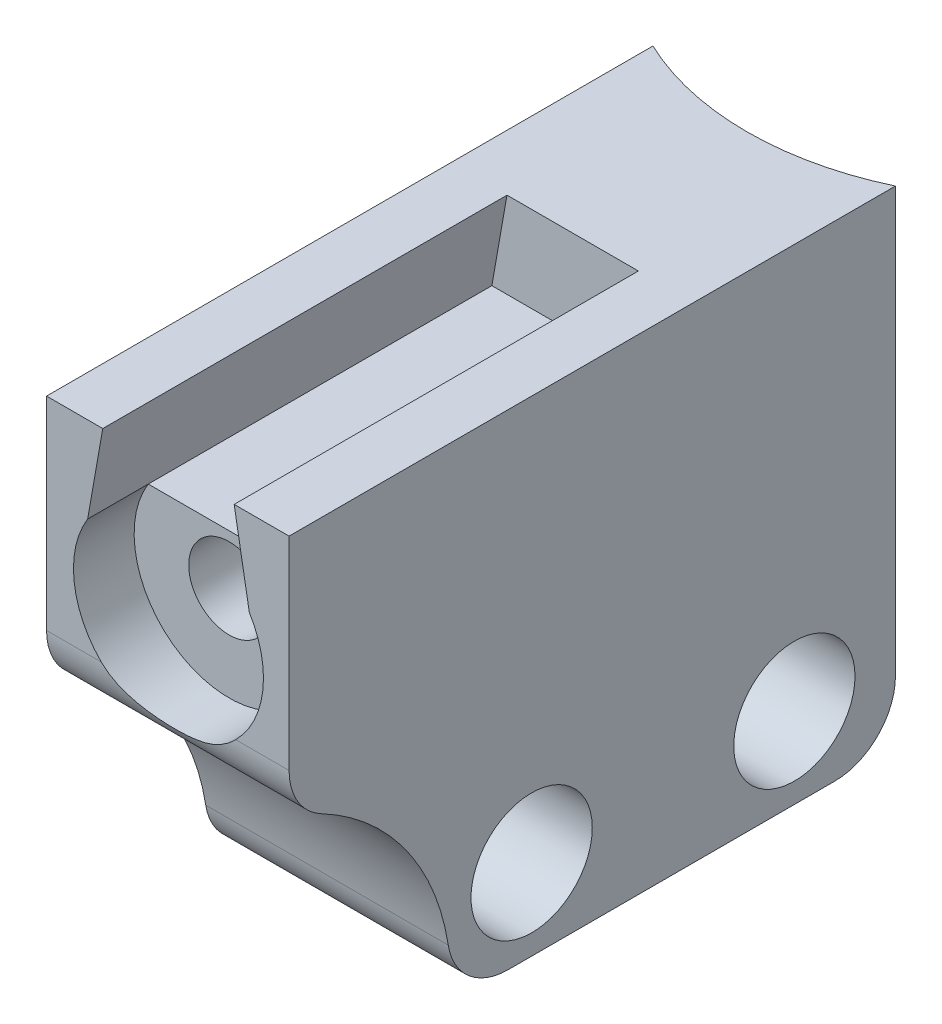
ISO-10303-21;
HEADER;
FILE_DESCRIPTION(('STEP AP214'),'2;1');
FILE_NAME('part.step','',(''),(''),'','','');
FILE_SCHEMA(('AUTOMOTIVE_DESIGN { 1 0 10303 214 1 1 1 1 }'));
ENDSEC;
DATA;
#1=APPLICATION_CONTEXT('core data for automotive mechanical design processes');
#2=APPLICATION_PROTOCOL_DEFINITION('international standard','automotive_design',2000,#1);
#3=PRODUCT_CONTEXT('',#1,'mechanical');
#4=PRODUCT('Part','Part','',(#3));
#5=PRODUCT_RELATED_PRODUCT_CATEGORY('part','',(#4));
#6=PRODUCT_DEFINITION_FORMATION('','',#4);
#7=PRODUCT_DEFINITION_CONTEXT('part definition',#1,'design');
#8=PRODUCT_DEFINITION('design','',#6,#7);
#9=PRODUCT_DEFINITION_SHAPE('','',#8);
#10=(LENGTH_UNIT() NAMED_UNIT(*) SI_UNIT(.MILLI.,.METRE.));
#11=(NAMED_UNIT(*) PLANE_ANGLE_UNIT() SI_UNIT($,.RADIAN.));
#12=(NAMED_UNIT(*) SI_UNIT($,.STERADIAN.) SOLID_ANGLE_UNIT());
#13=UNCERTAINTY_MEASURE_WITH_UNIT(LENGTH_MEASURE(1.E-05),#10,'distance_accuracy_value','');
#14=(GEOMETRIC_REPRESENTATION_CONTEXT(3) GLOBAL_UNCERTAINTY_ASSIGNED_CONTEXT((#13)) GLOBAL_UNIT_ASSIGNED_CONTEXT((#10,
#11,#12)) REPRESENTATION_CONTEXT('',''));
#15=CARTESIAN_POINT('',(0.,0.,0.));
#16=DIRECTION('',(0.,0.,1.));
#17=DIRECTION('',(1.,0.,0.));
#18=AXIS2_PLACEMENT_3D('',#15,#16,#17);
#19=CARTESIAN_POINT('',(0.0319635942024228,5.27874609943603,-15.));
#20=DIRECTION('',(0.,0.,1.));
#21=DIRECTION('',(1.,0.,0.));
#22=AXIS2_PLACEMENT_3D('',#19,#20,#21);
#23=CYLINDRICAL_SURFACE('',#22,2.);
#24=CARTESIAN_POINT('',(0.0319635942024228,5.27874609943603,12.));
#25=DIRECTION('',(0.,0.,1.));
#26=DIRECTION('',(1.,0.,0.));
#27=AXIS2_PLACEMENT_3D('',#24,#25,#26);
#28=CIRCLE('',#27,2.);
#29=CARTESIAN_POINT('',(2.03196359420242,5.27874609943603,12.));
#30=VERTEX_POINT('',#29);
#31=EDGE_CURVE('E273',#30,#30,#28,.T.);
#32=ORIENTED_EDGE('',*,*,#31,.T.);
#33=EDGE_LOOP('',(#32));
#34=FACE_BOUND('',#33,.T.);
#35=CARTESIAN_POINT('',(2.03196359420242,5.27874609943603,-13.7973553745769));
#36=CARTESIAN_POINT('',(2.03195893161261,5.39044647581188,-13.797353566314));
#37=CARTESIAN_POINT('',(2.02257418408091,5.50221322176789,-13.7959679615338));
#38=CARTESIAN_POINT('',(1.98529121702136,5.72262552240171,-13.7905768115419));
#39=CARTESIAN_POINT('',(1.95737454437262,5.83126785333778,-13.7865686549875));
#40=CARTESIAN_POINT('',(1.88387799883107,6.04220807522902,-13.776390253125));
#41=CARTESIAN_POINT('',(1.83831137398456,6.14451065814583,-13.7702216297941));
#42=CARTESIAN_POINT('',(1.73083964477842,6.34000149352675,-13.7564105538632));
#43=CARTESIAN_POINT('',(1.66893693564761,6.43319107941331,-13.7487683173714));
#44=CARTESIAN_POINT('',(1.53005599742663,6.6085240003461,-13.7327952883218));
#45=CARTESIAN_POINT('',(1.4529796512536,6.69058923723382,-13.7244602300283));
#46=CARTESIAN_POINT('',(1.28615175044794,6.84066865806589,-13.7080624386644));
#47=CARTESIAN_POINT('',(1.19639949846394,6.90868206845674,-13.6999997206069));
#48=CARTESIAN_POINT('',(1.00625389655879,7.02902469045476,-13.6849931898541));
#49=CARTESIAN_POINT('',(0.905813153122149,7.08127974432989,-13.678054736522));
#50=CARTESIAN_POINT('',(0.697465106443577,7.16814938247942,-13.6661060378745));
#51=CARTESIAN_POINT('',(0.589558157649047,7.20276480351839,-13.6610957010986));
#52=CARTESIAN_POINT('',(0.370114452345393,7.25314255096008,-13.6535763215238));
#53=CARTESIAN_POINT('',(0.258607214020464,7.26903092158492,-13.6510505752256));
#54=CARTESIAN_POINT('',(0.0344817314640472,7.28189149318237,-13.6487046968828));
#55=CARTESIAN_POINT('',(-0.0781364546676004,7.27886467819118,-13.6488844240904));
#56=CARTESIAN_POINT('',(-0.300393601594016,7.25408124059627,-13.6518956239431));
#57=CARTESIAN_POINT('',(-0.41004859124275,7.23246554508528,-13.6547071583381));
#58=CARTESIAN_POINT('',(-0.62416196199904,7.17133572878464,-13.6626204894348));
#59=CARTESIAN_POINT('',(-0.728620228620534,7.13182121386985,-13.6677223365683));
#60=CARTESIAN_POINT('',(-0.929758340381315,7.03588746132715,-13.6796531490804));
#61=CARTESIAN_POINT('',(-1.02641252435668,6.97941512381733,-13.6864875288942));
#62=CARTESIAN_POINT('',(-1.2089251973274,6.85120720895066,-13.7011037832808));
#63=CARTESIAN_POINT('',(-1.29478304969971,6.77947073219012,-13.7088857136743));
#64=CARTESIAN_POINT('',(-1.45406185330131,6.62201761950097,-13.7245934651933));
#65=CARTESIAN_POINT('',(-1.52736622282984,6.53618306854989,-13.7325199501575));
#66=CARTESIAN_POINT('',(-1.65854941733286,6.3533729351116,-13.7475428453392));
#67=CARTESIAN_POINT('',(-1.71642814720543,6.25639728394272,-13.7546392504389));
#68=CARTESIAN_POINT('',(-1.8151422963,6.05392028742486,-13.7671889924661));
#69=CARTESIAN_POINT('',(-1.85596301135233,5.94841167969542,-13.7726409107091));
#70=CARTESIAN_POINT('',(-1.91927376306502,5.73194296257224,-13.7812550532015));
#71=CARTESIAN_POINT('',(-1.94176492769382,5.62098318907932,-13.7844174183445));
#72=CARTESIAN_POINT('',(-1.96762369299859,5.39777074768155,-13.7880634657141));
#73=CARTESIAN_POINT('',(-1.97115206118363,5.28553705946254,-13.788569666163));
#74=CARTESIAN_POINT('',(-1.95941101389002,5.06208009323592,-13.7869051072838));
#75=CARTESIAN_POINT('',(-1.94414210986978,4.95085678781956,-13.7847344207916));
#76=CARTESIAN_POINT('',(-1.89537714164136,4.73307595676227,-13.777984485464));
#77=CARTESIAN_POINT('',(-1.861961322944,4.62650010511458,-13.7734158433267));
#78=CARTESIAN_POINT('',(-1.77793389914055,4.4204625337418,-13.7623998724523));
#79=CARTESIAN_POINT('',(-1.72732153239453,4.3210011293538,-13.7559524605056));
#80=CARTESIAN_POINT('',(-1.60994470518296,4.13128708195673,-13.7418613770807));
#81=CARTESIAN_POINT('',(-1.54307483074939,4.04110023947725,-13.7342100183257));
#82=CARTESIAN_POINT('',(-1.39522759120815,3.8731709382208,-13.7186098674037));
#83=CARTESIAN_POINT('',(-1.3142495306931,3.7954290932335,-13.7106610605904));
#84=CARTESIAN_POINT('',(-1.13978111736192,3.65402691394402,-13.695308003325));
#85=CARTESIAN_POINT('',(-1.04620468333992,3.59047225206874,-13.6879080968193));
#86=CARTESIAN_POINT('',(-0.849609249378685,3.47998471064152,-13.6745674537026));
#87=CARTESIAN_POINT('',(-0.746590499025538,3.4330513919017,-13.6686266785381));
#88=CARTESIAN_POINT('',(-0.534402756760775,3.35732132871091,-13.6589125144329));
#89=CARTESIAN_POINT('',(-0.425256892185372,3.328460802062,-13.6551315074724));
#90=CARTESIAN_POINT('',(-0.203612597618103,3.28948411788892,-13.6501527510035));
#91=CARTESIAN_POINT('',(-0.0911143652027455,3.27936685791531,-13.6489548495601));
#92=CARTESIAN_POINT('',(0.132989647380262,3.2781860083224,-13.6492977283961));
#93=CARTESIAN_POINT('',(0.244594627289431,3.28695654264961,-13.650814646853));
#94=CARTESIAN_POINT('',(0.46472162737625,3.32294487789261,-13.6563925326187));
#95=CARTESIAN_POINT('',(0.57324364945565,3.35016266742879,-13.6604534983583));
#96=CARTESIAN_POINT('',(0.784120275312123,3.42222432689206,-13.670687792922));
#97=CARTESIAN_POINT('',(0.886476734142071,3.46706286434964,-13.6768604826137));
#98=CARTESIAN_POINT('',(1.08223825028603,3.57307472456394,-13.6906579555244));
#99=CARTESIAN_POINT('',(1.17564306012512,3.63424849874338,-13.6982827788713));
#100=CARTESIAN_POINT('',(1.35172590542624,3.77182250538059,-13.7142359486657));
#101=CARTESIAN_POINT('',(1.43430373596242,3.84835036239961,-13.7225698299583));
#102=CARTESIAN_POINT('',(1.58550659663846,4.01419195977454,-13.7389715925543));
#103=CARTESIAN_POINT('',(1.65412834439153,4.10350869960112,-13.7470394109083));
#104=CARTESIAN_POINT('',(1.77577160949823,4.29291254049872,-13.7620511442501));
#105=CARTESIAN_POINT('',(1.82871407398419,4.39305085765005,-13.7689892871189));
#106=CARTESIAN_POINT('',(1.91694944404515,4.60085007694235,-13.7808986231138));
#107=CARTESIAN_POINT('',(1.9522609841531,4.70850289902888,-13.7858718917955));
#108=CARTESIAN_POINT('',(1.99607406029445,4.89367796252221,-13.7921269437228));
#109=CARTESIAN_POINT('',(2.0095123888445,4.97004684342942,-13.7940775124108));
#110=CARTESIAN_POINT('',(2.02745872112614,5.12384855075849,-13.7966923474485));
#111=CARTESIAN_POINT('',(2.03196682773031,5.20128136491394,-13.7973566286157));
#112=CARTESIAN_POINT('',(2.03196359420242,5.27874609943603,-13.7973553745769));
#113=B_SPLINE_CURVE_WITH_KNOTS('',3,(#35,#36,#37,#38,#39,#40,#41,#42,#43,#44,#45,#46,#47,#48,
#49,#50,#51,#52,#53,#54,#55,#56,#57,#58,#59,#60,#61,#62,#63,#64,#65,#66,#67,#68,#69,#70,#71,#72,
#73,#74,#75,#76,#77,#78,#79,#80,#81,#82,#83,#84,#85,#86,#87,#88,#89,#90,#91,#92,#93,#94,#95,#96,
#97,#98,#99,#100,#101,#102,#103,#104,#105,#106,#107,#108,#109,#110,#111,#112),.UNSPECIFIED.,.T.,
.F.,(4,2,2,2,2,2,2,2,2,2,2,2,2,2,2,2,2,2,2,2,2,2,2,2,2,2,2,2,2,2,2,2,2,2,2,2,2,2,4),(0.,
0.334817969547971,0.669969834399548,1.00487062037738,1.33972232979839,1.6768149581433,
2.0139261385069,2.35259983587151,2.69125746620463,3.02762247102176,3.36396997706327,
3.69778980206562,4.03161697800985,4.36650056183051,4.70140388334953,5.03926607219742,
5.37713034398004,5.7152852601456,6.05341936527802,6.38868217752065,6.7239358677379,
7.05771899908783,7.39151691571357,7.72753978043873,8.06357921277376,8.40204377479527,
8.74049939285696,9.07775370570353,9.4149881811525,9.74927308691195,10.0835577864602,
10.4177414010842,10.7519342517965,11.0890294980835,11.4262039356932,11.7650505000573,
12.1035381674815,12.3357386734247,12.5679365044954),.UNSPECIFIED.);
#114=CARTESIAN_POINT('',(2.03196359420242,5.27874609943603,-13.7973553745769));
#115=VERTEX_POINT('',#114);
#116=EDGE_CURVE('E11',#115,#115,#113,.T.);
#117=ORIENTED_EDGE('',*,*,#116,.F.);
#118=EDGE_LOOP('',(#117));
#119=FACE_BOUND('',#118,.T.);
#120=ADVANCED_FACE('F44',(#34,#119),#23,.F.);
#121=CARTESIAN_POINT('',(6.,-9.,-12.));
#122=DIRECTION('',(-1.,0.,0.));
#123=DIRECTION('',(0.,0.,1.));
#124=AXIS2_PLACEMENT_3D('',#121,#122,#123);
#125=CYLINDRICAL_SURFACE('',#124,3.);
#126=CARTESIAN_POINT('',(-6.,-9.,-12.));
#127=DIRECTION('',(-1.,0.,0.));
#128=DIRECTION('',(0.,0.,1.));
#129=AXIS2_PLACEMENT_3D('',#126,#127,#128);
#130=CIRCLE('',#129,3.);
#131=CARTESIAN_POINT('',(-6.,-8.99999999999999,-15.));
#132=VERTEX_POINT('',#131);
#133=CARTESIAN_POINT('',(-6.,-12.,-12.));
#134=VERTEX_POINT('',#133);
#135=EDGE_CURVE('E204',#132,#134,#130,.T.);
#136=ORIENTED_EDGE('',*,*,#135,.F.);
#137=CARTESIAN_POINT('',(-6.00000000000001,-9.,-15.));
#138=CARTESIAN_POINT('',(-6.00000657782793,-9.03868631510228,-15.0000043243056));
#139=CARTESIAN_POINT('',(-5.99842111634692,-9.07735100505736,-14.9992509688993));
#140=CARTESIAN_POINT('',(-5.99214002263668,-9.15434069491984,-14.9962739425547));
#141=CARTESIAN_POINT('',(-5.98744679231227,-9.19266593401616,-14.9940514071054));
#142=CARTESIAN_POINT('',(-5.9689254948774,-9.30608565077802,-14.9852991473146));
#143=CARTESIAN_POINT('',(-5.95065279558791,-9.38033762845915,-14.9766829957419));
#144=CARTESIAN_POINT('',(-5.90364706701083,-9.52436284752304,-14.9547179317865));
#145=CARTESIAN_POINT('',(-5.8749432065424,-9.59414794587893,-14.941382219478));
#146=CARTESIAN_POINT('',(-5.80873973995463,-9.72865689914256,-14.9109837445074));
#147=CARTESIAN_POINT('',(-5.77122085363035,-9.79336923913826,-14.8939128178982));
#148=CARTESIAN_POINT('',(-5.663206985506,-9.95627173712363,-14.8454622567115));
#149=CARTESIAN_POINT('',(-5.58682433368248,-10.0498819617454,-14.8118415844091));
#150=CARTESIAN_POINT('',(-5.42102147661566,-10.2231215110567,-14.7409464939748));
#151=CARTESIAN_POINT('',(-5.33156632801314,-10.3027120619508,-14.7036623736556));
#152=CARTESIAN_POINT('',(-5.15773522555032,-10.4385442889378,-14.6335347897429));
#153=CARTESIAN_POINT('',(-5.07460188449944,-10.4964976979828,-14.6008615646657));
#154=CARTESIAN_POINT('',(-4.90338040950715,-10.6046624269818,-14.5355579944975));
#155=CARTESIAN_POINT('',(-4.81528866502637,-10.6548680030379,-14.5029276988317));
#156=CARTESIAN_POINT('',(-4.63524768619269,-10.7485958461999,-14.4383711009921));
#157=CARTESIAN_POINT('',(-4.54329362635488,-10.7921094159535,-14.4064457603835));
#158=CARTESIAN_POINT('',(-4.35642562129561,-10.8732915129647,-14.343800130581));
#159=CARTESIAN_POINT('',(-4.26151056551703,-10.9109578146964,-14.3130803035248));
#160=CARTESIAN_POINT('',(-3.97865275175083,-11.0143926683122,-14.2249347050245));
#161=CARTESIAN_POINT('',(-3.78745414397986,-11.0731338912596,-14.1696668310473));
#162=CARTESIAN_POINT('',(-3.39916477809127,-11.1759287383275,-14.0665421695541));
#163=CARTESIAN_POINT('',(-3.20206883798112,-11.2199690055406,-14.0186921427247));
#164=CARTESIAN_POINT('',(-2.80330945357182,-11.2965536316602,-13.9311209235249));
#165=CARTESIAN_POINT('',(-2.60163466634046,-11.3290651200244,-13.8914231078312));
#166=CARTESIAN_POINT('',(-2.19554722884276,-11.3846771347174,-13.8208045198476));
#167=CARTESIAN_POINT('',(-1.99113522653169,-11.4077798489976,-13.7898817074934));
#168=CARTESIAN_POINT('',(-1.62667082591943,-11.4418337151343,-13.7430078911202));
#169=CARTESIAN_POINT('',(-1.46698945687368,-11.4543495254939,-13.7252536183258));
#170=CARTESIAN_POINT('',(-1.14682323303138,-11.4751796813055,-13.6952349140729));
#171=CARTESIAN_POINT('',(-0.986338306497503,-11.483493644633,-13.6829709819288));
#172=CARTESIAN_POINT('',(-0.664806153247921,-11.4962597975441,-13.6639762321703));
#173=CARTESIAN_POINT('',(-0.503758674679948,-11.5007099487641,-13.6572483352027));
#174=CARTESIAN_POINT('',(-0.181448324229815,-11.505920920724,-13.6493582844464));
#175=CARTESIAN_POINT('',(-0.0201854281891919,-11.5066812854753,-13.6481968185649));
#176=CARTESIAN_POINT('',(0.301923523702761,-11.504544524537,-13.6514419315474));
#177=CARTESIAN_POINT('',(0.462769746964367,-11.5016550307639,-13.6558368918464));
#178=CARTESIAN_POINT('',(0.784084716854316,-11.4921157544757,-13.6701597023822));
#179=CARTESIAN_POINT('',(0.944553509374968,-11.4854664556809,-13.6800868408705));
#180=CARTESIAN_POINT('',(1.26474525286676,-11.4681450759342,-13.7054312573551));
#181=CARTESIAN_POINT('',(1.42446859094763,-11.4574753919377,-13.7208452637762));
#182=CARTESIAN_POINT('',(1.742919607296,-11.4316844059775,-13.7571018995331));
#183=CARTESIAN_POINT('',(1.90164742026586,-11.4165637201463,-13.7779437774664));
#184=CARTESIAN_POINT('',(2.210762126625,-11.3820369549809,-13.8239214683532));
#185=CARTESIAN_POINT('',(2.36120756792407,-11.3628498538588,-13.848826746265));
#186=CARTESIAN_POINT('',(2.66045578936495,-11.3191306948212,-13.9033803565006));
#187=CARTESIAN_POINT('',(2.80925865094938,-11.294598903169,-13.9330284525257));
#188=CARTESIAN_POINT('',(3.10477985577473,-11.239247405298,-13.9968872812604));
#189=CARTESIAN_POINT('',(3.25149730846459,-11.20842509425,-14.0310999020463));
#190=CARTESIAN_POINT('',(3.54209281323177,-11.1393066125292,-14.1037796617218));
#191=CARTESIAN_POINT('',(3.68597139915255,-11.1010118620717,-14.1422459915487));
#192=CARTESIAN_POINT('',(3.93929073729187,-11.0246492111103,-14.2142532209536));
#193=CARTESIAN_POINT('',(4.04946041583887,-10.988317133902,-14.2470646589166));
#194=CARTESIAN_POINT('',(4.26681803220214,-10.9091874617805,-14.3146738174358));
#195=CARTESIAN_POINT('',(4.3740068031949,-10.8663916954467,-14.3494709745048));
#196=CARTESIAN_POINT('',(4.58428594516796,-10.7733258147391,-14.420482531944));
#197=CARTESIAN_POINT('',(4.68738599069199,-10.7230748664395,-14.4566931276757));
#198=CARTESIAN_POINT('',(4.88844373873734,-10.6137219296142,-14.5298675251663));
#199=CARTESIAN_POINT('',(4.98640583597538,-10.5546276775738,-14.5668306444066));
#200=CARTESIAN_POINT('',(5.17276484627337,-10.427824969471,-14.6394137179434));
#201=CARTESIAN_POINT('',(5.26135406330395,-10.3604078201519,-14.6750420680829));
#202=CARTESIAN_POINT('',(5.42951260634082,-10.2141647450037,-14.7445129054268));
#203=CARTESIAN_POINT('',(5.50908571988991,-10.1353436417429,-14.778356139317));
#204=CARTESIAN_POINT('',(5.64397027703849,-9.97841258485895,-14.8370013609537));
#205=CARTESIAN_POINT('',(5.70112946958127,-9.90213168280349,-14.8623887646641));
#206=CARTESIAN_POINT('',(5.80323466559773,-9.74041231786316,-14.9084040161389));
#207=CARTESIAN_POINT('',(5.84819801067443,-9.65498710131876,-14.9290386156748));
#208=CARTESIAN_POINT('',(5.91417327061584,-9.49578790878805,-14.9596038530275));
#209=CARTESIAN_POINT('',(5.9382739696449,-9.4235588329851,-14.9708889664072));
#210=CARTESIAN_POINT('',(5.97514464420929,-9.27571494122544,-14.9882230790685));
#211=CARTESIAN_POINT('',(5.9879423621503,-9.20010889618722,-14.9942848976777));
#212=CARTESIAN_POINT('',(5.99639650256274,-9.10334828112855,-14.9982913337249));
#213=CARTESIAN_POINT('',(5.99774710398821,-9.08270048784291,-14.9989316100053));
#214=CARTESIAN_POINT('',(5.99954782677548,-9.041371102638,-14.9997854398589));
#215=CARTESIAN_POINT('',(5.99999856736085,-9.02068954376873,-14.9999992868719));
#216=CARTESIAN_POINT('',(6.00000000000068,-9.00000000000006,-15.));
#217=B_SPLINE_CURVE_WITH_KNOTS('',3,(#137,#138,#139,#140,#141,#142,#143,#144,#145,#146,#147,
#148,#149,#150,#151,#152,#153,#154,#155,#156,#157,#158,#159,#160,#161,#162,#163,#164,#165,#166,
#167,#168,#169,#170,#171,#172,#173,#174,#175,#176,#177,#178,#179,#180,#181,#182,#183,#184,#185,
#186,#187,#188,#189,#190,#191,#192,#193,#194,#195,#196,#197,#198,#199,#200,#201,#202,#203,#204,
#205,#206,#207,#208,#209,#210,#211,#212,#213,#214,#215,#216),.UNSPECIFIED.,.F.,.F.,(4,2,2,2,2,2,
2,2,2,2,2,2,2,2,2,2,2,2,2,2,2,2,2,2,2,2,2,2,2,2,2,2,2,2,2,2,2,2,2,4),(0.,0.11597844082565,
0.231867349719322,0.461534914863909,0.690565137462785,0.920101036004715,1.29418067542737,
1.66927918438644,1.98825534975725,2.30746686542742,2.62708980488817,2.94683409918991,
3.56834306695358,4.19041519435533,4.814246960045,5.43793357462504,5.92124380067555,
6.4045979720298,6.88820698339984,7.37187575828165,7.85453484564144,8.33713185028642,
8.81944158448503,9.30168458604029,9.76261043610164,10.2235133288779,10.6846074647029,
11.1456140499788,11.5070956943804,11.8684752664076,12.2289413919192,12.5890939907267,
12.9390483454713,13.2888551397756,13.583773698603,13.8782706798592,14.1082791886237,
14.3377215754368,14.3998110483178,14.4618577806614),.UNSPECIFIED.);
#218=CARTESIAN_POINT('',(6.,-9.,-15.));
#219=VERTEX_POINT('',#218);
#220=EDGE_CURVE('E49',#132,#219,#217,.T.);
#221=ORIENTED_EDGE('',*,*,#220,.T.);
#222=CARTESIAN_POINT('',(6.,-9.,-12.));
#223=DIRECTION('',(-1.,0.,0.));
#224=DIRECTION('',(0.,0.,1.));
#225=AXIS2_PLACEMENT_3D('',#222,#223,#224);
#226=CIRCLE('',#225,3.);
#227=CARTESIAN_POINT('',(6.,-12.,-12.));
#228=VERTEX_POINT('',#227);
#229=EDGE_CURVE('E219',#228,#219,#226,.F.);
#230=ORIENTED_EDGE('',*,*,#229,.F.);
#231=DIRECTION('',(-1.,0.,0.));
#232=VECTOR('',#231,1.);
#233=CARTESIAN_POINT('',(6.,-12.,-12.));
#234=LINE('',#233,#232);
#235=EDGE_CURVE('E211',#134,#228,#234,.F.);
#236=ORIENTED_EDGE('',*,*,#235,.F.);
#237=EDGE_LOOP('',(#136,#221,#230,#236));
#238=FACE_BOUND('',#237,.T.);
#239=ADVANCED_FACE('F266',(#238),#125,.T.);
#240=CARTESIAN_POINT('',(6.,12.,15.));
#241=DIRECTION('',(0.,0.,-1.));
#242=DIRECTION('',(-1.,0.,0.));
#243=AXIS2_PLACEMENT_3D('',#240,#241,#242);
#244=PLANE('',#243);
#245=DIRECTION('',(-0.173648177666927,0.984807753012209,0.));
#246=VECTOR('',#245,1.);
#247=CARTESIAN_POINT('',(5.2351211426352,0.923093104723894,15.));
#248=LINE('',#247,#246);
#249=CARTESIAN_POINT('',(4.03196359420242,7.74653863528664,15.));
#250=VERTEX_POINT('',#249);
#251=CARTESIAN_POINT('',(3.28196359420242,12.,15.));
#252=VERTEX_POINT('',#251);
#253=EDGE_CURVE('E391',#250,#252,#248,.T.);
#254=ORIENTED_EDGE('',*,*,#253,.F.);
#255=CARTESIAN_POINT('',(0.0319635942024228,5.27874609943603,15.));
#256=DIRECTION('',(0.,0.,1.));
#257=DIRECTION('',(1.,0.,0.));
#258=AXIS2_PLACEMENT_3D('',#255,#256,#257);
#259=CIRCLE('',#258,4.7);
#260=CARTESIAN_POINT('',(3.35616422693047,1.95614318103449,15.));
#261=VERTEX_POINT('',#260);
#262=EDGE_CURVE('E180',#261,#250,#259,.T.);
#263=ORIENTED_EDGE('',*,*,#262,.F.);
#264=DIRECTION('',(-1.,0.,0.));
#265=VECTOR('',#264,1.);
#266=CARTESIAN_POINT('',(6.,1.95614318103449,15.));
#267=LINE('',#266,#265);
#268=CARTESIAN_POINT('',(6.,1.95614318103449,15.));
#269=VERTEX_POINT('',#268);
#270=EDGE_CURVE('E234',#261,#269,#267,.F.);
#271=ORIENTED_EDGE('',*,*,#270,.T.);
#272=DIRECTION('',(0.,-1.,0.));
#273=VECTOR('',#272,1.);
#274=CARTESIAN_POINT('',(6.,12.,15.));
#275=LINE('',#274,#273);
#276=CARTESIAN_POINT('',(6.,12.,15.));
#277=VERTEX_POINT('',#276);
#278=EDGE_CURVE('E183',#277,#269,#275,.T.);
#279=ORIENTED_EDGE('',*,*,#278,.F.);
#280=DIRECTION('',(-1.,0.,0.));
#281=VECTOR('',#280,1.);
#282=CARTESIAN_POINT('',(6.,12.,15.));
#283=LINE('',#282,#281);
#284=EDGE_CURVE('E195',#277,#252,#283,.T.);
#285=ORIENTED_EDGE('',*,*,#284,.T.);
#286=EDGE_LOOP('',(#254,#263,#271,#279,#285));
#287=FACE_BOUND('',#286,.T.);
#288=ADVANCED_FACE('F393',(#287),#244,.F.);
#289=CARTESIAN_POINT('',(-6.,1.95614318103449,15.));
#290=VERTEX_POINT('',#289);
#291=CARTESIAN_POINT('',(-3.29223703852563,1.95614318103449,15.));
#292=VERTEX_POINT('',#291);
#293=EDGE_CURVE('E231',#290,#292,#267,.F.);
#294=ORIENTED_EDGE('',*,*,#293,.T.);
#295=CARTESIAN_POINT('',(-3.96803640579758,7.74653863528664,15.));
#296=VERTEX_POINT('',#295);
#297=EDGE_CURVE('E68',#296,#292,#259,.T.);
#298=ORIENTED_EDGE('',*,*,#297,.F.);
#299=DIRECTION('',(-0.173648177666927,-0.984807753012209,0.));
#300=VECTOR('',#299,1.);
#301=CARTESIAN_POINT('',(-5.17312159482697,0.912160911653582,15.));
#302=LINE('',#301,#300);
#303=CARTESIAN_POINT('',(-3.21803640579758,12.,15.));
#304=VERTEX_POINT('',#303);
#305=EDGE_CURVE('E382',#304,#296,#302,.T.);
#306=ORIENTED_EDGE('',*,*,#305,.F.);
#307=CARTESIAN_POINT('',(-6.,12.,15.));
#308=VERTEX_POINT('',#307);
#309=EDGE_CURVE('E196',#304,#308,#283,.T.);
#310=ORIENTED_EDGE('',*,*,#309,.T.);
#311=DIRECTION('',(0.,-1.,0.));
#312=VECTOR('',#311,1.);
#313=CARTESIAN_POINT('',(-6.,12.,15.));
#314=LINE('',#313,#312);
#315=EDGE_CURVE('E181',#308,#290,#314,.T.);
#316=ORIENTED_EDGE('',*,*,#315,.T.);
#317=EDGE_LOOP('',(#294,#298,#306,#310,#316));
#318=FACE_BOUND('',#317,.T.);
#319=ADVANCED_FACE('F379',(#318),#244,.F.);
#320=CARTESIAN_POINT('',(6.,-11.3204973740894,18.9807460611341));
#321=DIRECTION('',(-1.,0.,0.));
#322=DIRECTION('',(0.,0.,1.));
#323=AXIS2_PLACEMENT_3D('',#320,#321,#322);
#324=PLANE('',#323);
#325=DIRECTION('',(0.,0.,-1.));
#326=VECTOR('',#325,1.);
#327=CARTESIAN_POINT('',(6.,-12.,7.));
#328=LINE('',#327,#326);
#329=CARTESIAN_POINT('',(6.,-12.,4.16132326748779));
#330=VERTEX_POINT('',#329);
#331=EDGE_CURVE('E337',#330,#228,#328,.T.);
#332=ORIENTED_EDGE('',*,*,#331,.T.);
#333=ORIENTED_EDGE('',*,*,#229,.T.);
#334=DIRECTION('',(0.,1.,0.));
#335=VECTOR('',#334,1.);
#336=CARTESIAN_POINT('',(6.,12.,-15.));
#337=LINE('',#336,#335);
#338=CARTESIAN_POINT('',(6.,12.,-15.));
#339=VERTEX_POINT('',#338);
#340=EDGE_CURVE('E345',#219,#339,#337,.T.);
#341=ORIENTED_EDGE('',*,*,#340,.T.);
#342=DIRECTION('',(0.,0.,1.));
#343=VECTOR('',#342,1.);
#344=CARTESIAN_POINT('',(6.,12.,15.));
#345=LINE('',#344,#343);
#346=EDGE_CURVE('E179',#339,#277,#345,.T.);
#347=ORIENTED_EDGE('',*,*,#346,.T.);
#348=ORIENTED_EDGE('',*,*,#278,.T.);
#349=CARTESIAN_POINT('',(6.,1.95614318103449,12.));
#350=DIRECTION('',(-1.,0.,0.));
#351=DIRECTION('',(0.,0.,1.));
#352=AXIS2_PLACEMENT_3D('',#349,#350,#351);
#353=CIRCLE('',#352,3.);
#354=CARTESIAN_POINT('',(6.,-0.699184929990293,13.3961492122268));
#355=VERTEX_POINT('',#354);
#356=EDGE_CURVE('E212',#269,#355,#353,.F.);
#357=ORIENTED_EDGE('',*,*,#356,.T.);
#358=CARTESIAN_POINT('',(6.,-11.3204973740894,18.9807460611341));
#359=DIRECTION('',(-1.,0.,0.));
#360=DIRECTION('',(0.,0.,1.));
#361=AXIS2_PLACEMENT_3D('',#358,#359,#360);
#362=CIRCLE('',#361,12.);
#363=CARTESIAN_POINT('',(6.,-9.46409947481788,7.12520782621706));
#364=VERTEX_POINT('',#363);
#365=EDGE_CURVE('E187',#355,#364,#362,.T.);
#366=ORIENTED_EDGE('',*,*,#365,.T.);
#367=CARTESIAN_POINT('',(6.,-9.,4.16132326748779));
#368=DIRECTION('',(-1.,0.,0.));
#369=DIRECTION('',(0.,0.,1.));
#370=AXIS2_PLACEMENT_3D('',#367,#368,#369);
#371=CIRCLE('',#370,3.);
#372=EDGE_CURVE('E220',#364,#330,#371,.F.);
#373=ORIENTED_EDGE('',*,*,#372,.T.);
#374=EDGE_LOOP('',(#332,#333,#341,#347,#348,#357,#366,#373));
#375=FACE_BOUND('',#374,.T.);
#376=CARTESIAN_POINT('',(6.,-8.,-10.));
#377=DIRECTION('',(1.,0.,0.));
#378=DIRECTION('',(0.,0.,-1.));
#379=AXIS2_PLACEMENT_3D('',#376,#377,#378);
#380=CIRCLE('',#379,3.);
#381=CARTESIAN_POINT('',(6.,-8.,-13.));
#382=VERTEX_POINT('',#381);
#383=EDGE_CURVE('E328',#382,#382,#380,.T.);
#384=ORIENTED_EDGE('',*,*,#383,.F.);
#385=EDGE_LOOP('',(#384));
#386=FACE_BOUND('',#385,.T.);
#387=CARTESIAN_POINT('',(6.,-8.,3.));
#388=DIRECTION('',(1.,0.,0.));
#389=DIRECTION('',(0.,0.,-1.));
#390=AXIS2_PLACEMENT_3D('',#387,#388,#389);
#391=CIRCLE('',#390,3.);
#392=CARTESIAN_POINT('',(6.,-8.,0.));
#393=VERTEX_POINT('',#392);
#394=EDGE_CURVE('E319',#393,#393,#391,.T.);
#395=ORIENTED_EDGE('',*,*,#394,.F.);
#396=EDGE_LOOP('',(#395));
#397=FACE_BOUND('',#396,.T.);
#398=ADVANCED_FACE('F365',(#375,#386,#397),#324,.F.);
#399=CARTESIAN_POINT('',(-6.,-11.3204973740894,18.9807460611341));
#400=DIRECTION('',(-1.,0.,0.));
#401=DIRECTION('',(0.,0.,1.));
#402=AXIS2_PLACEMENT_3D('',#399,#400,#401);
#403=PLANE('',#402);
#404=CARTESIAN_POINT('',(-6.,-8.,-10.));
#405=DIRECTION('',(1.,0.,0.));
#406=DIRECTION('',(0.,0.,-1.));
#407=AXIS2_PLACEMENT_3D('',#404,#405,#406);
#408=CIRCLE('',#407,3.);
#409=CARTESIAN_POINT('',(-6.,-8.,-13.));
#410=VERTEX_POINT('',#409);
#411=EDGE_CURVE('E322',#410,#410,#408,.T.);
#412=ORIENTED_EDGE('',*,*,#411,.T.);
#413=EDGE_LOOP('',(#412));
#414=FACE_BOUND('',#413,.T.);
#415=DIRECTION('',(0.,1.,0.));
#416=VECTOR('',#415,1.);
#417=CARTESIAN_POINT('',(-6.,12.,-15.));
#418=LINE('',#417,#416);
#419=CARTESIAN_POINT('',(-6.,12.,-15.));
#420=VERTEX_POINT('',#419);
#421=EDGE_CURVE('E154',#132,#420,#418,.T.);
#422=ORIENTED_EDGE('',*,*,#421,.F.);
#423=ORIENTED_EDGE('',*,*,#135,.T.);
#424=DIRECTION('',(0.,0.,-1.));
#425=VECTOR('',#424,1.);
#426=CARTESIAN_POINT('',(-6.,-12.,7.));
#427=LINE('',#426,#425);
#428=CARTESIAN_POINT('',(-6.,-12.,4.16132326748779));
#429=VERTEX_POINT('',#428);
#430=EDGE_CURVE('E170',#429,#134,#427,.T.);
#431=ORIENTED_EDGE('',*,*,#430,.F.);
#432=CARTESIAN_POINT('',(-6.,-9.,4.16132326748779));
#433=DIRECTION('',(-1.,0.,0.));
#434=DIRECTION('',(0.,0.,1.));
#435=AXIS2_PLACEMENT_3D('',#432,#433,#434);
#436=CIRCLE('',#435,3.);
#437=CARTESIAN_POINT('',(-6.,-9.46409947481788,7.12520782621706));
#438=VERTEX_POINT('',#437);
#439=EDGE_CURVE('E203',#429,#438,#436,.T.);
#440=ORIENTED_EDGE('',*,*,#439,.T.);
#441=CARTESIAN_POINT('',(-6.,-11.3204973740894,18.9807460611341));
#442=DIRECTION('',(-1.,0.,0.));
#443=DIRECTION('',(0.,0.,1.));
#444=AXIS2_PLACEMENT_3D('',#441,#442,#443);
#445=CIRCLE('',#444,12.);
#446=CARTESIAN_POINT('',(-6.,-0.699184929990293,13.3961492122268));
#447=VERTEX_POINT('',#446);
#448=EDGE_CURVE('E348',#447,#438,#445,.T.);
#449=ORIENTED_EDGE('',*,*,#448,.F.);
#450=CARTESIAN_POINT('',(-6.,1.95614318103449,12.));
#451=DIRECTION('',(-1.,0.,0.));
#452=DIRECTION('',(0.,0.,1.));
#453=AXIS2_PLACEMENT_3D('',#450,#451,#452);
#454=CIRCLE('',#453,3.);
#455=EDGE_CURVE('E197',#447,#290,#454,.T.);
#456=ORIENTED_EDGE('',*,*,#455,.T.);
#457=ORIENTED_EDGE('',*,*,#315,.F.);
#458=DIRECTION('',(0.,0.,1.));
#459=VECTOR('',#458,1.);
#460=CARTESIAN_POINT('',(-6.,12.,15.));
#461=LINE('',#460,#459);
#462=EDGE_CURVE('E167',#420,#308,#461,.T.);
#463=ORIENTED_EDGE('',*,*,#462,.F.);
#464=EDGE_LOOP('',(#422,#423,#431,#440,#449,#456,#457,#463));
#465=FACE_BOUND('',#464,.T.);
#466=CARTESIAN_POINT('',(-6.,-8.,3.));
#467=DIRECTION('',(1.,0.,0.));
#468=DIRECTION('',(0.,0.,-1.));
#469=AXIS2_PLACEMENT_3D('',#466,#467,#468);
#470=CIRCLE('',#469,3.);
#471=CARTESIAN_POINT('',(-6.,-8.,0.));
#472=VERTEX_POINT('',#471);
#473=EDGE_CURVE('E324',#472,#472,#470,.T.);
#474=ORIENTED_EDGE('',*,*,#473,.T.);
#475=EDGE_LOOP('',(#474));
#476=FACE_BOUND('',#475,.T.);
#477=ADVANCED_FACE('F177',(#414,#465,#476),#403,.T.);
#478=CARTESIAN_POINT('',(6.,-11.3204973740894,18.9807460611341));
#479=DIRECTION('',(-1.,0.,0.));
#480=DIRECTION('',(0.,0.,1.));
#481=AXIS2_PLACEMENT_3D('',#478,#479,#480);
#482=CYLINDRICAL_SURFACE('',#481,12.);
#483=ORIENTED_EDGE('',*,*,#448,.T.);
#484=DIRECTION('',(-1.,0.,0.));
#485=VECTOR('',#484,1.);
#486=CARTESIAN_POINT('',(6.,-9.46409947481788,7.12520782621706));
#487=LINE('',#486,#485);
#488=EDGE_CURVE('E226',#438,#364,#487,.F.);
#489=ORIENTED_EDGE('',*,*,#488,.T.);
#490=ORIENTED_EDGE('',*,*,#365,.F.);
#491=DIRECTION('',(-1.,0.,0.));
#492=VECTOR('',#491,1.);
#493=CARTESIAN_POINT('',(6.,-0.699184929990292,13.3961492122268));
#494=LINE('',#493,#492);
#495=EDGE_CURVE('E221',#355,#447,#494,.T.);
#496=ORIENTED_EDGE('',*,*,#495,.T.);
#497=EDGE_LOOP('',(#483,#489,#490,#496));
#498=FACE_BOUND('',#497,.T.);
#499=ADVANCED_FACE('F375',(#498),#482,.F.);
#500=CARTESIAN_POINT('',(6.,-12.,7.));
#501=DIRECTION('',(0.,1.,0.));
#502=DIRECTION('',(0.,0.,1.));
#503=AXIS2_PLACEMENT_3D('',#500,#501,#502);
#504=PLANE('',#503);
#505=ORIENTED_EDGE('',*,*,#430,.T.);
#506=ORIENTED_EDGE('',*,*,#235,.T.);
#507=ORIENTED_EDGE('',*,*,#331,.F.);
#508=DIRECTION('',(-1.,0.,0.));
#509=VECTOR('',#508,1.);
#510=CARTESIAN_POINT('',(6.,-12.,4.16132326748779));
#511=LINE('',#510,#509);
#512=EDGE_CURVE('E210',#330,#429,#511,.T.);
#513=ORIENTED_EDGE('',*,*,#512,.T.);
#514=EDGE_LOOP('',(#505,#506,#507,#513));
#515=FACE_BOUND('',#514,.T.);
#516=ADVANCED_FACE('F360',(#515),#504,.F.);
#517=CARTESIAN_POINT('',(6.,12.,15.));
#518=DIRECTION('',(0.,-1.,0.));
#519=DIRECTION('',(0.,0.,-1.));
#520=AXIS2_PLACEMENT_3D('',#517,#518,#519);
#521=PLANE('',#520);
#522=CARTESIAN_POINT('',(0.,12.,-27.6491106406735));
#523=DIRECTION('',(0.,-1.,0.));
#524=DIRECTION('',(0.,0.,-1.));
#525=AXIS2_PLACEMENT_3D('',#522,#523,#524);
#526=CIRCLE('',#525,14.);
#527=EDGE_CURVE('E157',#420,#339,#526,.F.);
#528=ORIENTED_EDGE('',*,*,#527,.F.);
#529=ORIENTED_EDGE('',*,*,#462,.T.);
#530=ORIENTED_EDGE('',*,*,#309,.F.);
#531=DIRECTION('',(0.,0.,1.));
#532=VECTOR('',#531,1.);
#533=CARTESIAN_POINT('',(-3.21803640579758,12.,-5.));
#534=LINE('',#533,#532);
#535=CARTESIAN_POINT('',(-3.21803640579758,12.,-5.));
#536=VERTEX_POINT('',#535);
#537=EDGE_CURVE('E311',#536,#304,#534,.T.);
#538=ORIENTED_EDGE('',*,*,#537,.F.);
#539=DIRECTION('',(-1.,0.,0.));
#540=VECTOR('',#539,1.);
#541=CARTESIAN_POINT('',(0.,12.,-5.));
#542=LINE('',#541,#540);
#543=CARTESIAN_POINT('',(3.28196359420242,12.,-5.));
#544=VERTEX_POINT('',#543);
#545=EDGE_CURVE('E316',#544,#536,#542,.T.);
#546=ORIENTED_EDGE('',*,*,#545,.F.);
#547=DIRECTION('',(0.,0.,1.));
#548=VECTOR('',#547,1.);
#549=CARTESIAN_POINT('',(3.28196359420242,12.,-5.));
#550=LINE('',#549,#548);
#551=EDGE_CURVE('E307',#544,#252,#550,.T.);
#552=ORIENTED_EDGE('',*,*,#551,.T.);
#553=ORIENTED_EDGE('',*,*,#284,.F.);
#554=ORIENTED_EDGE('',*,*,#346,.F.);
#555=EDGE_LOOP('',(#528,#529,#530,#538,#546,#552,#553,#554));
#556=FACE_BOUND('',#555,.T.);
#557=ADVANCED_FACE('F175',(#556),#521,.F.);
#558=CARTESIAN_POINT('',(6.,-8.,-10.));
#559=DIRECTION('',(-1.,0.,0.));
#560=DIRECTION('',(0.,0.,1.));
#561=AXIS2_PLACEMENT_3D('',#558,#559,#560);
#562=CYLINDRICAL_SURFACE('',#561,3.);
#563=ORIENTED_EDGE('',*,*,#383,.T.);
#564=EDGE_LOOP('',(#563));
#565=FACE_BOUND('',#564,.T.);
#566=ORIENTED_EDGE('',*,*,#411,.F.);
#567=EDGE_LOOP('',(#566));
#568=FACE_BOUND('',#567,.T.);
#569=ADVANCED_FACE('F434',(#565,#568),#562,.F.);
#570=CARTESIAN_POINT('',(6.,-8.,3.));
#571=DIRECTION('',(-1.,0.,0.));
#572=DIRECTION('',(0.,0.,1.));
#573=AXIS2_PLACEMENT_3D('',#570,#571,#572);
#574=CYLINDRICAL_SURFACE('',#573,3.);
#575=ORIENTED_EDGE('',*,*,#394,.T.);
#576=EDGE_LOOP('',(#575));
#577=FACE_BOUND('',#576,.T.);
#578=ORIENTED_EDGE('',*,*,#473,.F.);
#579=EDGE_LOOP('',(#578));
#580=FACE_BOUND('',#579,.T.);
#581=ADVANCED_FACE('F268',(#577,#580),#574,.F.);
#582=CARTESIAN_POINT('',(6.,-9.,4.16132326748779));
#583=DIRECTION('',(-1.,0.,0.));
#584=DIRECTION('',(0.,0.,1.));
#585=AXIS2_PLACEMENT_3D('',#582,#583,#584);
#586=CYLINDRICAL_SURFACE('',#585,3.);
#587=ORIENTED_EDGE('',*,*,#372,.F.);
#588=ORIENTED_EDGE('',*,*,#488,.F.);
#589=ORIENTED_EDGE('',*,*,#439,.F.);
#590=ORIENTED_EDGE('',*,*,#512,.F.);
#591=EDGE_LOOP('',(#587,#588,#589,#590));
#592=FACE_BOUND('',#591,.T.);
#593=ADVANCED_FACE('F366',(#592),#586,.T.);
#594=CARTESIAN_POINT('',(6.,1.95614318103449,12.));
#595=DIRECTION('',(-1.,0.,0.));
#596=DIRECTION('',(0.,0.,1.));
#597=AXIS2_PLACEMENT_3D('',#594,#595,#596);
#598=CYLINDRICAL_SURFACE('',#597,3.);
#599=CARTESIAN_POINT('',(-3.29223703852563,1.95614318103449,15.));
#600=CARTESIAN_POINT('',(-3.20170975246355,1.86554611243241,14.9999853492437));
#601=CARTESIAN_POINT('',(-3.10753948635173,1.77876069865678,14.9958987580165));
#602=CARTESIAN_POINT('',(-2.91284924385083,1.61346109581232,14.9815198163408));
#603=CARTESIAN_POINT('',(-2.81233837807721,1.53493545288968,14.9712361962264));
#604=CARTESIAN_POINT('',(-2.60573797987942,1.38661298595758,14.946401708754));
#605=CARTESIAN_POINT('',(-2.4996535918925,1.31680830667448,14.9318547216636));
#606=CARTESIAN_POINT('',(-2.28247672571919,1.18613693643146,14.9002767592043));
#607=CARTESIAN_POINT('',(-2.1713825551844,1.12527329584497,14.8832449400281));
#608=CARTESIAN_POINT('',(-1.84226034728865,0.961894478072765,14.8326816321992));
#609=CARTESIAN_POINT('',(-1.61821490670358,0.871365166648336,14.7981322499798));
#610=CARTESIAN_POINT('',(-1.27331926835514,0.762018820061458,14.752381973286));
#611=CARTESIAN_POINT('',(-1.15686530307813,0.729975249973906,14.7381425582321));
#612=CARTESIAN_POINT('',(-0.921524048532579,0.67489547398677,14.712808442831));
#613=CARTESIAN_POINT('',(-0.802637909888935,0.651855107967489,14.7017122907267));
#614=CARTESIAN_POINT('',(-0.553364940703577,0.613495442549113,14.6828707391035));
#615=CARTESIAN_POINT('',(-0.422830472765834,0.598958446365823,14.6754721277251));
#616=CARTESIAN_POINT('',(-0.160797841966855,0.580864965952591,14.666217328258));
#617=CARTESIAN_POINT('',(-0.029299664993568,0.577308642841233,14.6643612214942));
#618=CARTESIAN_POINT('',(0.23351888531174,0.581230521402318,14.6663869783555));
#619=CARTESIAN_POINT('',(0.364839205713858,0.588711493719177,14.6702702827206));
#620=CARTESIAN_POINT('',(0.626117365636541,0.614604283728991,14.6833713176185));
#621=CARTESIAN_POINT('',(0.756075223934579,0.633015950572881,14.6925889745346));
#622=CARTESIAN_POINT('',(1.00128429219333,0.678263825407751,14.7143299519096));
#623=CARTESIAN_POINT('',(1.11675257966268,0.704125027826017,14.7264524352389));
#624=CARTESIAN_POINT('',(1.3451421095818,0.764376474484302,14.7533208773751));
#625=CARTESIAN_POINT('',(1.45806223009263,0.798770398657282,14.7680679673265));
#626=CARTESIAN_POINT('',(1.79214465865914,0.914435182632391,14.8145657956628));
#627=CARTESIAN_POINT('',(2.00885149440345,1.00823045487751,14.8485967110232));
#628=CARTESIAN_POINT('',(2.32152980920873,1.1724376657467,14.8963829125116));
#629=CARTESIAN_POINT('',(2.42365996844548,1.23106877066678,14.9117636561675));
#630=CARTESIAN_POINT('',(2.6234783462,1.3560026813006,14.9400570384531));
#631=CARTESIAN_POINT('',(2.72116803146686,1.42230292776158,14.9529704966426));
#632=CARTESIAN_POINT('',(2.91170841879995,1.56242200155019,14.9748984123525));
#633=CARTESIAN_POINT('',(3.00455179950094,1.6362517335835,14.9839071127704));
#634=CARTESIAN_POINT('',(3.18470774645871,1.79100178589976,14.9964560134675));
#635=CARTESIAN_POINT('',(3.27201327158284,1.87193083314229,14.999989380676));
#636=CARTESIAN_POINT('',(3.35616422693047,1.95614318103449,15.));
#637=B_SPLINE_CURVE_WITH_KNOTS('',3,(#599,#600,#601,#602,#603,#604,#605,#606,#607,#608,#609,
#610,#611,#612,#613,#614,#615,#616,#617,#618,#619,#620,#621,#622,#623,#624,#625,#626,#627,#628,
#629,#630,#631,#632,#633,#634,#635,#636),.UNSPECIFIED.,.F.,.F.,(4,2,2,2,2,2,2,2,2,2,2,2,2,2,2,2,
2,2,4),(0.,0.383876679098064,0.767213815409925,1.15020313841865,1.53332282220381,
2.26222241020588,2.62677782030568,2.99116458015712,3.38524874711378,3.7793386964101,
4.17352758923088,4.5677110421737,4.92416606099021,5.28077507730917,5.99331728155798,
6.34934883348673,6.70526191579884,7.06169797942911,7.418578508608),.UNSPECIFIED.);
#638=EDGE_CURVE('E232',#292,#261,#637,.T.);
#639=ORIENTED_EDGE('',*,*,#638,.F.);
#640=ORIENTED_EDGE('',*,*,#293,.F.);
#641=ORIENTED_EDGE('',*,*,#455,.F.);
#642=ORIENTED_EDGE('',*,*,#495,.F.);
#643=ORIENTED_EDGE('',*,*,#356,.F.);
#644=ORIENTED_EDGE('',*,*,#270,.F.);
#645=EDGE_LOOP('',(#639,#640,#641,#642,#643,#644));
#646=FACE_BOUND('',#645,.T.);
#647=ADVANCED_FACE('F50',(#646),#598,.T.);
#648=CARTESIAN_POINT('',(0.,7.74653863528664,-5.));
#649=DIRECTION('',(0.,-1.,0.));
#650=DIRECTION('',(0.,0.,-1.));
#651=AXIS2_PLACEMENT_3D('',#648,#649,#650);
#652=PLANE('',#651);
#653=DIRECTION('',(0.,0.,1.));
#654=VECTOR('',#653,1.);
#655=CARTESIAN_POINT('',(-3.96803640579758,7.74653863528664,-5.));
#656=LINE('',#655,#654);
#657=CARTESIAN_POINT('',(-3.96803640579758,7.74653863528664,-5.));
#658=VERTEX_POINT('',#657);
#659=CARTESIAN_POINT('',(-3.96803640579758,7.74653863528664,12.));
#660=VERTEX_POINT('',#659);
#661=EDGE_CURVE('E299',#658,#660,#656,.T.);
#662=ORIENTED_EDGE('',*,*,#661,.T.);
#663=DIRECTION('',(1.,0.,0.));
#664=VECTOR('',#663,1.);
#665=CARTESIAN_POINT('',(0.,7.74653863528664,12.));
#666=LINE('',#665,#664);
#667=CARTESIAN_POINT('',(4.03196359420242,7.74653863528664,12.));
#668=VERTEX_POINT('',#667);
#669=EDGE_CURVE('E291',#660,#668,#666,.T.);
#670=ORIENTED_EDGE('',*,*,#669,.T.);
#671=DIRECTION('',(0.,0.,1.));
#672=VECTOR('',#671,1.);
#673=CARTESIAN_POINT('',(4.03196359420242,7.74653863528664,-5.));
#674=LINE('',#673,#672);
#675=CARTESIAN_POINT('',(4.03196359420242,7.74653863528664,-5.));
#676=VERTEX_POINT('',#675);
#677=EDGE_CURVE('E297',#676,#668,#674,.T.);
#678=ORIENTED_EDGE('',*,*,#677,.F.);
#679=DIRECTION('',(1.,0.,0.));
#680=VECTOR('',#679,1.);
#681=CARTESIAN_POINT('',(0.,7.74653863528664,-5.));
#682=LINE('',#681,#680);
#683=EDGE_CURVE('E398',#658,#676,#682,.T.);
#684=ORIENTED_EDGE('',*,*,#683,.F.);
#685=EDGE_LOOP('',(#662,#670,#678,#684));
#686=FACE_BOUND('',#685,.T.);
#687=ADVANCED_FACE('F254',(#686),#652,.F.);
#688=CARTESIAN_POINT('',(-5.17312159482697,0.912160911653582,-5.));
#689=DIRECTION('',(-0.984807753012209,0.173648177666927,0.));
#690=DIRECTION('',(-0.173648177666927,-0.984807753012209,0.));
#691=AXIS2_PLACEMENT_3D('',#688,#689,#690);
#692=PLANE('',#691);
#693=ORIENTED_EDGE('',*,*,#305,.T.);
#694=DIRECTION('',(0.,0.,1.));
#695=VECTOR('',#694,1.);
#696=CARTESIAN_POINT('',(-3.96803640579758,7.74653863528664,12.));
#697=LINE('',#696,#695);
#698=EDGE_CURVE('E394',#660,#296,#697,.T.);
#699=ORIENTED_EDGE('',*,*,#698,.F.);
#700=ORIENTED_EDGE('',*,*,#661,.F.);
#701=DIRECTION('',(-0.173648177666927,-0.984807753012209,0.));
#702=VECTOR('',#701,1.);
#703=CARTESIAN_POINT('',(-5.17312159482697,0.912160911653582,-5.));
#704=LINE('',#703,#702);
#705=EDGE_CURVE('E306',#536,#658,#704,.T.);
#706=ORIENTED_EDGE('',*,*,#705,.F.);
#707=ORIENTED_EDGE('',*,*,#537,.T.);
#708=EDGE_LOOP('',(#693,#699,#700,#706,#707));
#709=FACE_BOUND('',#708,.T.);
#710=ADVANCED_FACE('F252',(#709),#692,.F.);
#711=CARTESIAN_POINT('',(5.2351211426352,0.923093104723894,-5.));
#712=DIRECTION('',(0.984807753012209,0.173648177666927,0.));
#713=DIRECTION('',(-0.173648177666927,0.984807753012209,0.));
#714=AXIS2_PLACEMENT_3D('',#711,#712,#713);
#715=PLANE('',#714);
#716=ORIENTED_EDGE('',*,*,#253,.T.);
#717=ORIENTED_EDGE('',*,*,#551,.F.);
#718=DIRECTION('',(-0.173648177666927,0.984807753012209,0.));
#719=VECTOR('',#718,1.);
#720=CARTESIAN_POINT('',(5.2351211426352,0.923093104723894,-5.));
#721=LINE('',#720,#719);
#722=EDGE_CURVE('E80',#676,#544,#721,.T.);
#723=ORIENTED_EDGE('',*,*,#722,.F.);
#724=ORIENTED_EDGE('',*,*,#677,.T.);
#725=DIRECTION('',(0.,0.,1.));
#726=VECTOR('',#725,1.);
#727=CARTESIAN_POINT('',(4.03196359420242,7.74653863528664,12.));
#728=LINE('',#727,#726);
#729=EDGE_CURVE('E301',#668,#250,#728,.T.);
#730=ORIENTED_EDGE('',*,*,#729,.T.);
#731=EDGE_LOOP('',(#716,#717,#723,#724,#730));
#732=FACE_BOUND('',#731,.T.);
#733=ADVANCED_FACE('F253',(#732),#715,.F.);
#734=CARTESIAN_POINT('',(0.,0.,-5.));
#735=DIRECTION('',(0.,0.,1.));
#736=DIRECTION('',(1.,0.,0.));
#737=AXIS2_PLACEMENT_3D('',#734,#735,#736);
#738=PLANE('',#737);
#739=ORIENTED_EDGE('',*,*,#683,.T.);
#740=ORIENTED_EDGE('',*,*,#722,.T.);
#741=ORIENTED_EDGE('',*,*,#545,.T.);
#742=ORIENTED_EDGE('',*,*,#705,.T.);
#743=EDGE_LOOP('',(#739,#740,#741,#742));
#744=FACE_BOUND('',#743,.T.);
#745=ADVANCED_FACE('F250',(#744),#738,.T.);
#746=CARTESIAN_POINT('',(0.0319635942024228,5.27874609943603,12.));
#747=DIRECTION('',(0.,0.,1.));
#748=DIRECTION('',(1.,0.,0.));
#749=AXIS2_PLACEMENT_3D('',#746,#747,#748);
#750=CYLINDRICAL_SURFACE('',#749,4.7);
#751=ORIENTED_EDGE('',*,*,#638,.T.);
#752=ORIENTED_EDGE('',*,*,#262,.T.);
#753=ORIENTED_EDGE('',*,*,#729,.F.);
#754=CARTESIAN_POINT('',(0.0319635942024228,5.27874609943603,12.));
#755=DIRECTION('',(0.,0.,1.));
#756=DIRECTION('',(1.,0.,0.));
#757=AXIS2_PLACEMENT_3D('',#754,#755,#756);
#758=CIRCLE('',#757,4.7);
#759=EDGE_CURVE('E292',#660,#668,#758,.T.);
#760=ORIENTED_EDGE('',*,*,#759,.F.);
#761=ORIENTED_EDGE('',*,*,#698,.T.);
#762=ORIENTED_EDGE('',*,*,#297,.T.);
#763=EDGE_LOOP('',(#751,#752,#753,#760,#761,#762));
#764=FACE_BOUND('',#763,.T.);
#765=ADVANCED_FACE('F245',(#764),#750,.F.);
#766=CARTESIAN_POINT('',(0.,0.,12.));
#767=DIRECTION('',(0.,0.,1.));
#768=DIRECTION('',(1.,0.,0.));
#769=AXIS2_PLACEMENT_3D('',#766,#767,#768);
#770=PLANE('',#769);
#771=ORIENTED_EDGE('',*,*,#31,.F.);
#772=EDGE_LOOP('',(#771));
#773=FACE_BOUND('',#772,.T.);
#774=ORIENTED_EDGE('',*,*,#759,.T.);
#775=ORIENTED_EDGE('',*,*,#669,.F.);
#776=EDGE_LOOP('',(#774,#775));
#777=FACE_BOUND('',#776,.T.);
#778=ADVANCED_FACE('F246',(#773,#777),#770,.T.);
#779=CARTESIAN_POINT('',(0.,67.628356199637,-27.6491106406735));
#780=DIRECTION('',(0.,-1.,0.));
#781=DIRECTION('',(0.,0.,-1.));
#782=AXIS2_PLACEMENT_3D('',#779,#780,#781);
#783=CYLINDRICAL_SURFACE('',#782,14.);
#784=ORIENTED_EDGE('',*,*,#421,.T.);
#785=ORIENTED_EDGE('',*,*,#527,.T.);
#786=ORIENTED_EDGE('',*,*,#340,.F.);
#787=ORIENTED_EDGE('',*,*,#220,.F.);
#788=EDGE_LOOP('',(#784,#785,#786,#787));
#789=FACE_BOUND('',#788,.T.);
#790=ORIENTED_EDGE('',*,*,#116,.T.);
#791=EDGE_LOOP('',(#790));
#792=FACE_BOUND('',#791,.T.);
#793=ADVANCED_FACE('F160',(#789,#792),#783,.F.);
#794=CLOSED_SHELL('',(#120,#239,#288,#319,#398,#477,#499,#516,#557,#569,#581,#593,#647,#687,
#710,#733,#745,#765,#778,#793));
#795=MANIFOLD_SOLID_BREP('B2',#794);
#796=ADVANCED_BREP_SHAPE_REPRESENTATION('',(#18,#795),#14);
#797=SHAPE_DEFINITION_REPRESENTATION(#9,#796);
ENDSEC;
END-ISO-10303-21;
